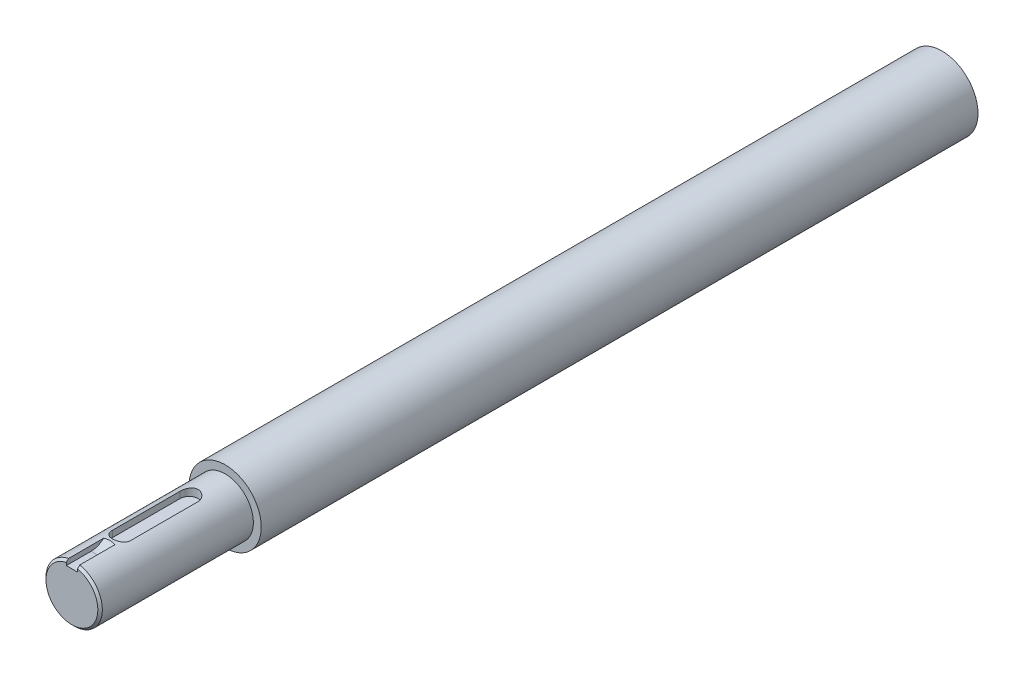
from build123d import *

# Parameters (mm, degrees)
ESQUISSE1_R                  = 12.5
BASE_EXTRUSION_DEPTH         = 68
CHANFREIN1_SIZE              = 1
ENL_V_MAT_EXTRU_1_REACH      = 74.405
ESQUISSE5_R                  = 16
BOSS_EXTRU_1_DEPTH           = 318
ENL_V_MAT_EXTRU_2_DEPTH      = 2.5
ENL_V_MAT_EXTRU_2_DEPTH_BACK = 2.5


with BuildPart() as part:
    # Esquisse1 → Base-Extrusion (new body)
    with BuildSketch(Plane.XY):
        with Locations(Location((0, 0, 0), (0, 0, 180))):
            Circle(ESQUISSE1_R)
    extrude(amount=BASE_EXTRUSION_DEPTH)

    # Chanfrein1
    chanfrein1_edges = [part.edges().sort_by_distance(p)[0] for p in [
        (12.5, 0, 68),
    ]]
    chamfer(chanfrein1_edges, length=CHANFREIN1_SIZE)

    # Esquisse4 → Enl_v. mat.-Extru.1 (cut, up to next)
    with BuildSketch(Plane.XZ.offset(-9), mode=Mode.PRIVATE) as enl_v_mat_extru_1_sk1:
        with BuildLine():
            Line((-4, 16), (-4, 46))
            ThreePointArc((-4, 46), (0, 50), (4, 46))
            Line((4, 46), (4, 16))
            ThreePointArc((4, 16), (0, 12), (-4, 16))
        make_face()
    enl_v_mat_extru_1_tool1 = extrude(enl_v_mat_extru_1_sk1.sketch, amount=-ENL_V_MAT_EXTRU_1_REACH, mode=Mode.PRIVATE) & part.part
    add(enl_v_mat_extru_1_tool1.solids().sort_by_distance((0, 9, 31))[0], mode=Mode.SUBTRACT)

    # Esquisse5 → Boss.-Extru.1 (add)
    with BuildSketch(Plane(origin=(0, 0, 0), x_dir=(-1, 0, 0), z_dir=(0, 0, -1))):
        with Locations(Location((0, 0, 0), (0, 0, 180))):
            Circle(ESQUISSE5_R)
    extrude(amount=BOSS_EXTRU_1_DEPTH)

    # Esquisse6 → Enl_v. mat.-Extru.2 (cut, two sides: drawn at the far end of the back side and taken through both)
    with BuildSketch(Plane(origin=(0, 0, 0), x_dir=(0, 0, -1), z_dir=(1, 0, 0)).offset(-ENL_V_MAT_EXTRU_2_DEPTH_BACK)):
        with BuildLine():
            Line((-70, 10), (-57, 10))
            ThreePointArc((-57, 10), (-50.67544468, 13.101020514), (-49.254033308, 20))
            Line((-49.254033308, 20), (-70, 20))
            Line((-70, 20), (-70, 10))
        make_face()
    extrude(amount=ENL_V_MAT_EXTRU_2_DEPTH + ENL_V_MAT_EXTRU_2_DEPTH_BACK, mode=Mode.SUBTRACT)


solid = part.part
